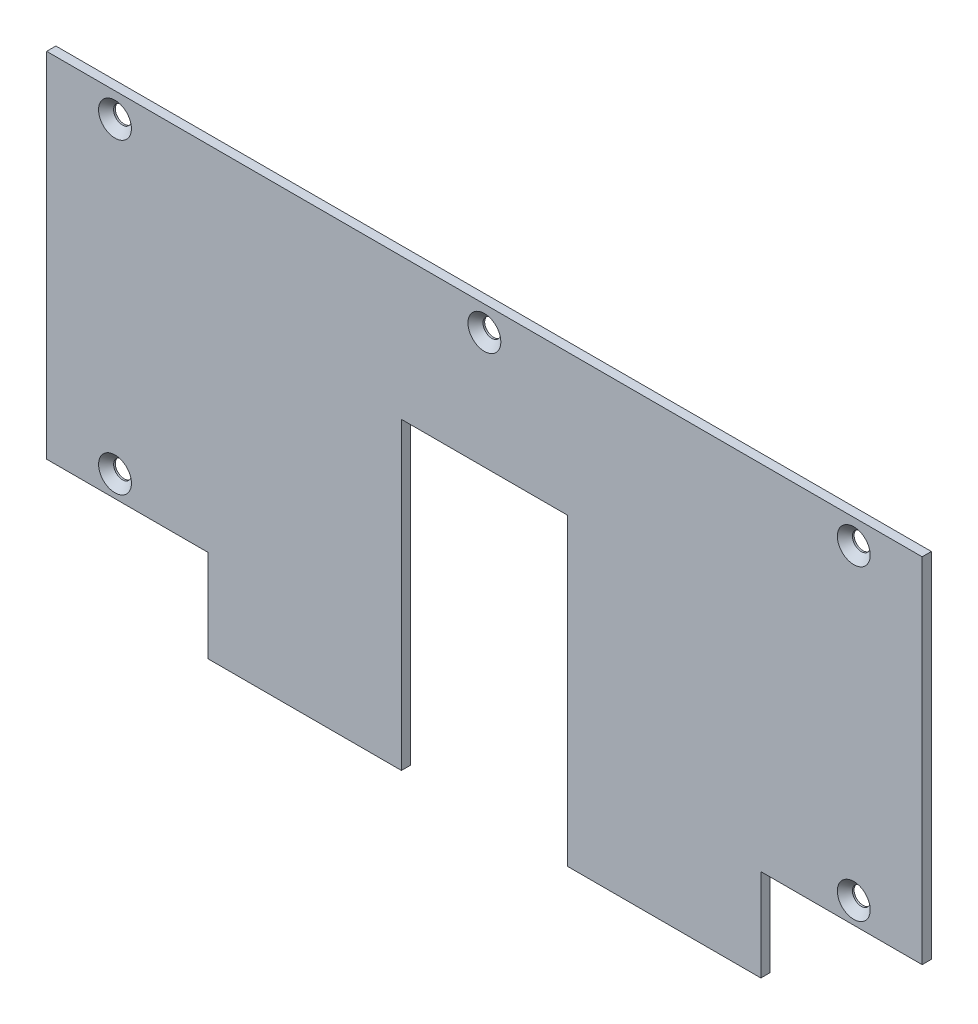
ISO-10303-21;
HEADER;
FILE_DESCRIPTION(('STEP AP214'),'2;1');
FILE_NAME('part.step','',(''),(''),'','','');
FILE_SCHEMA(('AUTOMOTIVE_DESIGN { 1 0 10303 214 1 1 1 1 }'));
ENDSEC;
DATA;
#1=APPLICATION_CONTEXT('core data for automotive mechanical design processes');
#2=APPLICATION_PROTOCOL_DEFINITION('international standard','automotive_design',2000,#1);
#3=PRODUCT_CONTEXT('',#1,'mechanical');
#4=PRODUCT('Part','Part','',(#3));
#5=PRODUCT_RELATED_PRODUCT_CATEGORY('part','',(#4));
#6=PRODUCT_DEFINITION_FORMATION('','',#4);
#7=PRODUCT_DEFINITION_CONTEXT('part definition',#1,'design');
#8=PRODUCT_DEFINITION('design','',#6,#7);
#9=PRODUCT_DEFINITION_SHAPE('','',#8);
#10=(LENGTH_UNIT() NAMED_UNIT(*) SI_UNIT(.MILLI.,.METRE.));
#11=(NAMED_UNIT(*) PLANE_ANGLE_UNIT() SI_UNIT($,.RADIAN.));
#12=(NAMED_UNIT(*) SI_UNIT($,.STERADIAN.) SOLID_ANGLE_UNIT());
#13=UNCERTAINTY_MEASURE_WITH_UNIT(LENGTH_MEASURE(1.E-05),#10,'distance_accuracy_value','');
#14=(GEOMETRIC_REPRESENTATION_CONTEXT(3) GLOBAL_UNCERTAINTY_ASSIGNED_CONTEXT((#13)) GLOBAL_UNIT_ASSIGNED_CONTEXT((#10,
#11,#12)) REPRESENTATION_CONTEXT('',''));
#15=CARTESIAN_POINT('',(0.,0.,0.));
#16=DIRECTION('',(0.,0.,1.));
#17=DIRECTION('',(1.,0.,0.));
#18=AXIS2_PLACEMENT_3D('',#15,#16,#17);
#19=CARTESIAN_POINT('',(0.,31.2258979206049,0.));
#20=DIRECTION('',(0.,0.,1.));
#21=DIRECTION('',(1.,0.,0.));
#22=AXIS2_PLACEMENT_3D('',#19,#20,#21);
#23=PLANE('',#22);
#24=CARTESIAN_POINT('',(-120.25,-8.,0.));
#25=DIRECTION('',(0.,0.,1.));
#26=DIRECTION('',(1.,0.,0.));
#27=AXIS2_PLACEMENT_3D('',#24,#25,#26);
#28=CIRCLE('',#27,5.34999999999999);
#29=CARTESIAN_POINT('',(-114.9,-8.,0.));
#30=VERTEX_POINT('',#29);
#31=EDGE_CURVE('E125',#30,#30,#28,.F.);
#32=ORIENTED_EDGE('',*,*,#31,.T.);
#33=EDGE_LOOP('',(#32));
#34=FACE_BOUND('',#33,.T.);
#35=CARTESIAN_POINT('',(-120.25,92.,0.));
#36=DIRECTION('',(0.,0.,1.));
#37=DIRECTION('',(1.,0.,0.));
#38=AXIS2_PLACEMENT_3D('',#35,#36,#37);
#39=CIRCLE('',#38,5.34999999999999);
#40=CARTESIAN_POINT('',(-114.9,92.,0.));
#41=VERTEX_POINT('',#40);
#42=EDGE_CURVE('E148',#41,#41,#39,.F.);
#43=ORIENTED_EDGE('',*,*,#42,.T.);
#44=EDGE_LOOP('',(#43));
#45=FACE_BOUND('',#44,.T.);
#46=CARTESIAN_POINT('',(0.,92.,0.));
#47=DIRECTION('',(0.,0.,1.));
#48=DIRECTION('',(1.,0.,0.));
#49=AXIS2_PLACEMENT_3D('',#46,#47,#48);
#50=CIRCLE('',#49,5.35);
#51=CARTESIAN_POINT('',(5.35000000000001,92.,0.));
#52=VERTEX_POINT('',#51);
#53=EDGE_CURVE('E151',#52,#52,#50,.F.);
#54=ORIENTED_EDGE('',*,*,#53,.T.);
#55=EDGE_LOOP('',(#54));
#56=FACE_BOUND('',#55,.T.);
#57=CARTESIAN_POINT('',(120.25,92.,0.));
#58=DIRECTION('',(0.,0.,1.));
#59=DIRECTION('',(1.,0.,0.));
#60=AXIS2_PLACEMENT_3D('',#57,#58,#59);
#61=CIRCLE('',#60,5.35000000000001);
#62=CARTESIAN_POINT('',(125.6,92.,0.));
#63=VERTEX_POINT('',#62);
#64=EDGE_CURVE('E153',#63,#63,#61,.F.);
#65=ORIENTED_EDGE('',*,*,#64,.T.);
#66=EDGE_LOOP('',(#65));
#67=FACE_BOUND('',#66,.T.);
#68=CARTESIAN_POINT('',(120.25,-8.,0.));
#69=DIRECTION('',(0.,0.,1.));
#70=DIRECTION('',(1.,0.,0.));
#71=AXIS2_PLACEMENT_3D('',#68,#69,#70);
#72=CIRCLE('',#71,5.34999999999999);
#73=CARTESIAN_POINT('',(125.6,-8.,0.));
#74=VERTEX_POINT('',#73);
#75=EDGE_CURVE('E19',#74,#74,#72,.F.);
#76=ORIENTED_EDGE('',*,*,#75,.T.);
#77=EDGE_LOOP('',(#76));
#78=FACE_BOUND('',#77,.T.);
#79=DIRECTION('',(0.,1.,0.));
#80=VECTOR('',#79,1.);
#81=CARTESIAN_POINT('',(-90.,-15.,0.));
#82=LINE('',#81,#80);
#83=CARTESIAN_POINT('',(-90.,-45.,0.));
#84=VERTEX_POINT('',#83);
#85=CARTESIAN_POINT('',(-90.,-15.,0.));
#86=VERTEX_POINT('',#85);
#87=EDGE_CURVE('E345',#84,#86,#82,.T.);
#88=ORIENTED_EDGE('',*,*,#87,.F.);
#89=DIRECTION('',(1.,0.,0.));
#90=VECTOR('',#89,1.);
#91=CARTESIAN_POINT('',(-90.,-45.,0.));
#92=LINE('',#91,#90);
#93=CARTESIAN_POINT('',(-27.,-45.,0.));
#94=VERTEX_POINT('',#93);
#95=EDGE_CURVE('E341',#94,#84,#92,.F.);
#96=ORIENTED_EDGE('',*,*,#95,.F.);
#97=DIRECTION('',(0.,1.,0.));
#98=VECTOR('',#97,1.);
#99=CARTESIAN_POINT('',(-27.,-45.,0.));
#100=LINE('',#99,#98);
#101=CARTESIAN_POINT('',(-27.,54.,0.));
#102=VERTEX_POINT('',#101);
#103=EDGE_CURVE('E338',#102,#94,#100,.F.);
#104=ORIENTED_EDGE('',*,*,#103,.F.);
#105=DIRECTION('',(1.,0.,0.));
#106=VECTOR('',#105,1.);
#107=CARTESIAN_POINT('',(-27.,54.,0.));
#108=LINE('',#107,#106);
#109=CARTESIAN_POINT('',(27.,54.,0.));
#110=VERTEX_POINT('',#109);
#111=EDGE_CURVE('E121',#110,#102,#108,.F.);
#112=ORIENTED_EDGE('',*,*,#111,.F.);
#113=DIRECTION('',(0.,1.,0.));
#114=VECTOR('',#113,1.);
#115=CARTESIAN_POINT('',(27.,54.,0.));
#116=LINE('',#115,#114);
#117=CARTESIAN_POINT('',(27.,-45.,0.));
#118=VERTEX_POINT('',#117);
#119=EDGE_CURVE('E116',#118,#110,#116,.T.);
#120=ORIENTED_EDGE('',*,*,#119,.F.);
#121=DIRECTION('',(1.,0.,0.));
#122=VECTOR('',#121,1.);
#123=CARTESIAN_POINT('',(27.,-45.,0.));
#124=LINE('',#123,#122);
#125=CARTESIAN_POINT('',(90.,-45.,0.));
#126=VERTEX_POINT('',#125);
#127=EDGE_CURVE('E107',#126,#118,#124,.F.);
#128=ORIENTED_EDGE('',*,*,#127,.F.);
#129=DIRECTION('',(0.,1.,0.));
#130=VECTOR('',#129,1.);
#131=CARTESIAN_POINT('',(90.,-45.,0.));
#132=LINE('',#131,#130);
#133=CARTESIAN_POINT('',(90.,-15.,0.));
#134=VERTEX_POINT('',#133);
#135=EDGE_CURVE('E102',#134,#126,#132,.F.);
#136=ORIENTED_EDGE('',*,*,#135,.F.);
#137=DIRECTION('',(1.,0.,0.));
#138=VECTOR('',#137,1.);
#139=CARTESIAN_POINT('',(90.,-15.,0.));
#140=LINE('',#139,#138);
#141=CARTESIAN_POINT('',(142.5,-15.,0.));
#142=VERTEX_POINT('',#141);
#143=EDGE_CURVE('E365',#142,#134,#140,.F.);
#144=ORIENTED_EDGE('',*,*,#143,.F.);
#145=DIRECTION('',(0.,1.,0.));
#146=VECTOR('',#145,1.);
#147=CARTESIAN_POINT('',(142.5,-15.,0.));
#148=LINE('',#147,#146);
#149=CARTESIAN_POINT('',(142.5,100.,0.));
#150=VERTEX_POINT('',#149);
#151=EDGE_CURVE('E361',#150,#142,#148,.F.);
#152=ORIENTED_EDGE('',*,*,#151,.F.);
#153=DIRECTION('',(1.,0.,0.));
#154=VECTOR('',#153,1.);
#155=CARTESIAN_POINT('',(142.5,100.,0.));
#156=LINE('',#155,#154);
#157=CARTESIAN_POINT('',(-142.5,100.,0.));
#158=VERTEX_POINT('',#157);
#159=EDGE_CURVE('E357',#158,#150,#156,.T.);
#160=ORIENTED_EDGE('',*,*,#159,.F.);
#161=DIRECTION('',(0.,1.,0.));
#162=VECTOR('',#161,1.);
#163=CARTESIAN_POINT('',(-142.5,100.,0.));
#164=LINE('',#163,#162);
#165=CARTESIAN_POINT('',(-142.5,-15.,0.));
#166=VERTEX_POINT('',#165);
#167=EDGE_CURVE('E353',#166,#158,#164,.T.);
#168=ORIENTED_EDGE('',*,*,#167,.F.);
#169=DIRECTION('',(1.,0.,0.));
#170=VECTOR('',#169,1.);
#171=CARTESIAN_POINT('',(-142.5,-15.,0.));
#172=LINE('',#171,#170);
#173=EDGE_CURVE('E349',#86,#166,#172,.F.);
#174=ORIENTED_EDGE('',*,*,#173,.F.);
#175=EDGE_LOOP('',(#88,#96,#104,#112,#120,#128,#136,#144,#152,#160,#168,#174));
#176=FACE_BOUND('',#175,.T.);
#177=ADVANCED_FACE('F15',(#34,#45,#56,#67,#78,#176),#23,.T.);
#178=CARTESIAN_POINT('',(120.25,-8.,0.));
#179=DIRECTION('',(0.,0.,1.));
#180=DIRECTION('',(1.,0.,0.));
#181=AXIS2_PLACEMENT_3D('',#178,#179,#180);
#182=CONICAL_SURFACE('',#181,5.35000000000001,0.785398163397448);
#183=CARTESIAN_POINT('',(120.25,-8.,-2.44999999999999));
#184=DIRECTION('',(0.,0.,-1.));
#185=DIRECTION('',(-1.,0.,0.));
#186=AXIS2_PLACEMENT_3D('',#183,#184,#185);
#187=CIRCLE('',#186,2.90000000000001);
#188=CARTESIAN_POINT('',(117.35,-8.,-2.44999999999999));
#189=VERTEX_POINT('',#188);
#190=EDGE_CURVE('E327',#189,#189,#187,.T.);
#191=ORIENTED_EDGE('',*,*,#190,.T.);
#192=EDGE_LOOP('',(#191));
#193=FACE_BOUND('',#192,.T.);
#194=ORIENTED_EDGE('',*,*,#75,.F.);
#195=EDGE_LOOP('',(#194));
#196=FACE_BOUND('',#195,.T.);
#197=ADVANCED_FACE('F161',(#193,#196),#182,.F.);
#198=CARTESIAN_POINT('',(120.25,92.,0.));
#199=DIRECTION('',(0.,0.,1.));
#200=DIRECTION('',(1.,0.,0.));
#201=AXIS2_PLACEMENT_3D('',#198,#199,#200);
#202=CONICAL_SURFACE('',#201,5.34999999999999,0.785398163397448);
#203=CARTESIAN_POINT('',(120.25,92.,-2.44999999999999));
#204=DIRECTION('',(0.,0.,-1.));
#205=DIRECTION('',(-1.,0.,0.));
#206=AXIS2_PLACEMENT_3D('',#203,#204,#205);
#207=CIRCLE('',#206,2.89999999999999);
#208=CARTESIAN_POINT('',(117.35,92.,-2.44999999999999));
#209=VERTEX_POINT('',#208);
#210=EDGE_CURVE('E322',#209,#209,#207,.T.);
#211=ORIENTED_EDGE('',*,*,#210,.T.);
#212=EDGE_LOOP('',(#211));
#213=FACE_BOUND('',#212,.T.);
#214=ORIENTED_EDGE('',*,*,#64,.F.);
#215=EDGE_LOOP('',(#214));
#216=FACE_BOUND('',#215,.T.);
#217=ADVANCED_FACE('F163',(#213,#216),#202,.F.);
#218=CARTESIAN_POINT('',(0.,92.,0.));
#219=DIRECTION('',(0.,0.,1.));
#220=DIRECTION('',(1.,0.,0.));
#221=AXIS2_PLACEMENT_3D('',#218,#219,#220);
#222=CONICAL_SURFACE('',#221,5.35,0.785398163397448);
#223=CARTESIAN_POINT('',(0.,92.,-2.44999999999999));
#224=DIRECTION('',(0.,0.,-1.));
#225=DIRECTION('',(-1.,0.,0.));
#226=AXIS2_PLACEMENT_3D('',#223,#224,#225);
#227=CIRCLE('',#226,2.9);
#228=CARTESIAN_POINT('',(-2.89999999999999,92.,-2.44999999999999));
#229=VERTEX_POINT('',#228);
#230=EDGE_CURVE('E317',#229,#229,#227,.T.);
#231=ORIENTED_EDGE('',*,*,#230,.T.);
#232=EDGE_LOOP('',(#231));
#233=FACE_BOUND('',#232,.T.);
#234=ORIENTED_EDGE('',*,*,#53,.F.);
#235=EDGE_LOOP('',(#234));
#236=FACE_BOUND('',#235,.T.);
#237=ADVANCED_FACE('F171',(#233,#236),#222,.F.);
#238=CARTESIAN_POINT('',(-120.25,92.,0.));
#239=DIRECTION('',(0.,0.,1.));
#240=DIRECTION('',(1.,0.,0.));
#241=AXIS2_PLACEMENT_3D('',#238,#239,#240);
#242=CONICAL_SURFACE('',#241,5.34999999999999,0.785398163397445);
#243=CARTESIAN_POINT('',(-120.25,92.,-2.44999999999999));
#244=DIRECTION('',(0.,0.,-1.));
#245=DIRECTION('',(-1.,0.,0.));
#246=AXIS2_PLACEMENT_3D('',#243,#244,#245);
#247=CIRCLE('',#246,2.90000000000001);
#248=CARTESIAN_POINT('',(-123.15,92.,-2.44999999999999));
#249=VERTEX_POINT('',#248);
#250=EDGE_CURVE('E264',#249,#249,#247,.T.);
#251=ORIENTED_EDGE('',*,*,#250,.T.);
#252=EDGE_LOOP('',(#251));
#253=FACE_BOUND('',#252,.T.);
#254=ORIENTED_EDGE('',*,*,#42,.F.);
#255=EDGE_LOOP('',(#254));
#256=FACE_BOUND('',#255,.T.);
#257=ADVANCED_FACE('F235',(#253,#256),#242,.F.);
#258=CARTESIAN_POINT('',(-120.25,-8.,0.));
#259=DIRECTION('',(0.,0.,1.));
#260=DIRECTION('',(1.,0.,0.));
#261=AXIS2_PLACEMENT_3D('',#258,#259,#260);
#262=CONICAL_SURFACE('',#261,5.34999999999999,0.785398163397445);
#263=CARTESIAN_POINT('',(-120.25,-8.,-2.44999999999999));
#264=DIRECTION('',(0.,0.,-1.));
#265=DIRECTION('',(-1.,0.,0.));
#266=AXIS2_PLACEMENT_3D('',#263,#264,#265);
#267=CIRCLE('',#266,2.90000000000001);
#268=CARTESIAN_POINT('',(-123.15,-8.,-2.44999999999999));
#269=VERTEX_POINT('',#268);
#270=EDGE_CURVE('E312',#269,#269,#267,.T.);
#271=ORIENTED_EDGE('',*,*,#270,.T.);
#272=EDGE_LOOP('',(#271));
#273=FACE_BOUND('',#272,.T.);
#274=ORIENTED_EDGE('',*,*,#31,.F.);
#275=EDGE_LOOP('',(#274));
#276=FACE_BOUND('',#275,.T.);
#277=ADVANCED_FACE('F231',(#273,#276),#262,.F.);
#278=CARTESIAN_POINT('',(27.,54.,0.));
#279=DIRECTION('',(-1.,0.,0.));
#280=DIRECTION('',(0.,0.,1.));
#281=AXIS2_PLACEMENT_3D('',#278,#279,#280);
#282=PLANE('',#281);
#283=ORIENTED_EDGE('',*,*,#119,.T.);
#284=DIRECTION('',(0.,0.,-1.));
#285=VECTOR('',#284,1.);
#286=CARTESIAN_POINT('',(27.,54.,0.));
#287=LINE('',#286,#285);
#288=CARTESIAN_POINT('',(27.,54.,-3.));
#289=VERTEX_POINT('',#288);
#290=EDGE_CURVE('E335',#289,#110,#287,.F.);
#291=ORIENTED_EDGE('',*,*,#290,.F.);
#292=DIRECTION('',(0.,1.,0.));
#293=VECTOR('',#292,1.);
#294=CARTESIAN_POINT('',(27.,31.2258979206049,-3.));
#295=LINE('',#294,#293);
#296=CARTESIAN_POINT('',(27.,-45.,-3.));
#297=VERTEX_POINT('',#296);
#298=EDGE_CURVE('E129',#289,#297,#295,.F.);
#299=ORIENTED_EDGE('',*,*,#298,.T.);
#300=DIRECTION('',(0.,0.,-1.));
#301=VECTOR('',#300,1.);
#302=CARTESIAN_POINT('',(27.,-45.,0.));
#303=LINE('',#302,#301);
#304=EDGE_CURVE('E112',#118,#297,#303,.T.);
#305=ORIENTED_EDGE('',*,*,#304,.F.);
#306=EDGE_LOOP('',(#283,#291,#299,#305));
#307=FACE_BOUND('',#306,.T.);
#308=ADVANCED_FACE('F128',(#307),#282,.T.);
#309=CARTESIAN_POINT('',(27.,-45.,0.));
#310=DIRECTION('',(0.,-1.,0.));
#311=DIRECTION('',(0.,0.,-1.));
#312=AXIS2_PLACEMENT_3D('',#309,#310,#311);
#313=PLANE('',#312);
#314=ORIENTED_EDGE('',*,*,#127,.T.);
#315=ORIENTED_EDGE('',*,*,#304,.T.);
#316=DIRECTION('',(1.,0.,0.));
#317=VECTOR('',#316,1.);
#318=CARTESIAN_POINT('',(0.,-45.,-3.));
#319=LINE('',#318,#317);
#320=CARTESIAN_POINT('',(90.,-45.,-3.));
#321=VERTEX_POINT('',#320);
#322=EDGE_CURVE('E309',#297,#321,#319,.T.);
#323=ORIENTED_EDGE('',*,*,#322,.T.);
#324=DIRECTION('',(0.,0.,-1.));
#325=VECTOR('',#324,1.);
#326=CARTESIAN_POINT('',(90.,-45.,0.));
#327=LINE('',#326,#325);
#328=EDGE_CURVE('E114',#126,#321,#327,.T.);
#329=ORIENTED_EDGE('',*,*,#328,.F.);
#330=EDGE_LOOP('',(#314,#315,#323,#329));
#331=FACE_BOUND('',#330,.T.);
#332=ADVANCED_FACE('F109',(#331),#313,.T.);
#333=CARTESIAN_POINT('',(90.,-45.,0.));
#334=DIRECTION('',(1.,0.,0.));
#335=DIRECTION('',(0.,0.,-1.));
#336=AXIS2_PLACEMENT_3D('',#333,#334,#335);
#337=PLANE('',#336);
#338=ORIENTED_EDGE('',*,*,#135,.T.);
#339=ORIENTED_EDGE('',*,*,#328,.T.);
#340=DIRECTION('',(0.,1.,0.));
#341=VECTOR('',#340,1.);
#342=CARTESIAN_POINT('',(90.,31.2258979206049,-3.));
#343=LINE('',#342,#341);
#344=CARTESIAN_POINT('',(90.,-15.,-3.));
#345=VERTEX_POINT('',#344);
#346=EDGE_CURVE('E306',#321,#345,#343,.T.);
#347=ORIENTED_EDGE('',*,*,#346,.T.);
#348=DIRECTION('',(0.,0.,-1.));
#349=VECTOR('',#348,1.);
#350=CARTESIAN_POINT('',(90.,-15.,0.));
#351=LINE('',#350,#349);
#352=EDGE_CURVE('E363',#134,#345,#351,.T.);
#353=ORIENTED_EDGE('',*,*,#352,.F.);
#354=EDGE_LOOP('',(#338,#339,#347,#353));
#355=FACE_BOUND('',#354,.T.);
#356=ADVANCED_FACE('F224',(#355),#337,.T.);
#357=CARTESIAN_POINT('',(90.,-15.,0.));
#358=DIRECTION('',(0.,-1.,0.));
#359=DIRECTION('',(0.,0.,-1.));
#360=AXIS2_PLACEMENT_3D('',#357,#358,#359);
#361=PLANE('',#360);
#362=ORIENTED_EDGE('',*,*,#143,.T.);
#363=ORIENTED_EDGE('',*,*,#352,.T.);
#364=DIRECTION('',(1.,0.,0.));
#365=VECTOR('',#364,1.);
#366=CARTESIAN_POINT('',(0.,-15.,-3.));
#367=LINE('',#366,#365);
#368=CARTESIAN_POINT('',(142.5,-15.,-3.));
#369=VERTEX_POINT('',#368);
#370=EDGE_CURVE('E303',#345,#369,#367,.T.);
#371=ORIENTED_EDGE('',*,*,#370,.T.);
#372=DIRECTION('',(0.,0.,-1.));
#373=VECTOR('',#372,1.);
#374=CARTESIAN_POINT('',(142.5,-15.,0.));
#375=LINE('',#374,#373);
#376=EDGE_CURVE('E359',#142,#369,#375,.T.);
#377=ORIENTED_EDGE('',*,*,#376,.F.);
#378=EDGE_LOOP('',(#362,#363,#371,#377));
#379=FACE_BOUND('',#378,.T.);
#380=ADVANCED_FACE('F220',(#379),#361,.T.);
#381=CARTESIAN_POINT('',(142.5,-15.,0.));
#382=DIRECTION('',(1.,0.,0.));
#383=DIRECTION('',(0.,0.,-1.));
#384=AXIS2_PLACEMENT_3D('',#381,#382,#383);
#385=PLANE('',#384);
#386=ORIENTED_EDGE('',*,*,#151,.T.);
#387=ORIENTED_EDGE('',*,*,#376,.T.);
#388=DIRECTION('',(0.,1.,0.));
#389=VECTOR('',#388,1.);
#390=CARTESIAN_POINT('',(142.5,31.2258979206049,-3.));
#391=LINE('',#390,#389);
#392=CARTESIAN_POINT('',(142.5,100.,-3.));
#393=VERTEX_POINT('',#392);
#394=EDGE_CURVE('E300',#369,#393,#391,.T.);
#395=ORIENTED_EDGE('',*,*,#394,.T.);
#396=DIRECTION('',(0.,0.,1.));
#397=VECTOR('',#396,1.);
#398=CARTESIAN_POINT('',(142.5,100.,0.));
#399=LINE('',#398,#397);
#400=EDGE_CURVE('E355',#150,#393,#399,.F.);
#401=ORIENTED_EDGE('',*,*,#400,.F.);
#402=EDGE_LOOP('',(#386,#387,#395,#401));
#403=FACE_BOUND('',#402,.T.);
#404=ADVANCED_FACE('F216',(#403),#385,.T.);
#405=CARTESIAN_POINT('',(142.5,100.,0.));
#406=DIRECTION('',(0.,1.,0.));
#407=DIRECTION('',(0.,0.,1.));
#408=AXIS2_PLACEMENT_3D('',#405,#406,#407);
#409=PLANE('',#408);
#410=ORIENTED_EDGE('',*,*,#159,.T.);
#411=ORIENTED_EDGE('',*,*,#400,.T.);
#412=DIRECTION('',(1.,0.,0.));
#413=VECTOR('',#412,1.);
#414=CARTESIAN_POINT('',(0.,100.,-3.));
#415=LINE('',#414,#413);
#416=CARTESIAN_POINT('',(-142.5,100.,-3.));
#417=VERTEX_POINT('',#416);
#418=EDGE_CURVE('E297',#393,#417,#415,.F.);
#419=ORIENTED_EDGE('',*,*,#418,.T.);
#420=DIRECTION('',(0.,0.,1.));
#421=VECTOR('',#420,1.);
#422=CARTESIAN_POINT('',(-142.5,100.,0.));
#423=LINE('',#422,#421);
#424=EDGE_CURVE('E351',#158,#417,#423,.F.);
#425=ORIENTED_EDGE('',*,*,#424,.F.);
#426=EDGE_LOOP('',(#410,#411,#419,#425));
#427=FACE_BOUND('',#426,.T.);
#428=ADVANCED_FACE('F212',(#427),#409,.T.);
#429=CARTESIAN_POINT('',(-142.5,100.,0.));
#430=DIRECTION('',(-1.,0.,0.));
#431=DIRECTION('',(0.,0.,1.));
#432=AXIS2_PLACEMENT_3D('',#429,#430,#431);
#433=PLANE('',#432);
#434=ORIENTED_EDGE('',*,*,#167,.T.);
#435=ORIENTED_EDGE('',*,*,#424,.T.);
#436=DIRECTION('',(0.,1.,0.));
#437=VECTOR('',#436,1.);
#438=CARTESIAN_POINT('',(-142.5,31.2258979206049,-3.));
#439=LINE('',#438,#437);
#440=CARTESIAN_POINT('',(-142.5,-15.,-3.));
#441=VERTEX_POINT('',#440);
#442=EDGE_CURVE('E294',#417,#441,#439,.F.);
#443=ORIENTED_EDGE('',*,*,#442,.T.);
#444=DIRECTION('',(0.,0.,-1.));
#445=VECTOR('',#444,1.);
#446=CARTESIAN_POINT('',(-142.5,-15.,0.));
#447=LINE('',#446,#445);
#448=EDGE_CURVE('E347',#166,#441,#447,.T.);
#449=ORIENTED_EDGE('',*,*,#448,.F.);
#450=EDGE_LOOP('',(#434,#435,#443,#449));
#451=FACE_BOUND('',#450,.T.);
#452=ADVANCED_FACE('F208',(#451),#433,.T.);
#453=CARTESIAN_POINT('',(-142.5,-15.,0.));
#454=DIRECTION('',(0.,-1.,0.));
#455=DIRECTION('',(0.,0.,-1.));
#456=AXIS2_PLACEMENT_3D('',#453,#454,#455);
#457=PLANE('',#456);
#458=ORIENTED_EDGE('',*,*,#173,.T.);
#459=ORIENTED_EDGE('',*,*,#448,.T.);
#460=DIRECTION('',(1.,0.,0.));
#461=VECTOR('',#460,1.);
#462=CARTESIAN_POINT('',(0.,-15.,-3.));
#463=LINE('',#462,#461);
#464=CARTESIAN_POINT('',(-90.,-15.,-3.));
#465=VERTEX_POINT('',#464);
#466=EDGE_CURVE('E288',#441,#465,#463,.T.);
#467=ORIENTED_EDGE('',*,*,#466,.T.);
#468=DIRECTION('',(0.,0.,1.));
#469=VECTOR('',#468,1.);
#470=CARTESIAN_POINT('',(-90.,-15.,0.));
#471=LINE('',#470,#469);
#472=EDGE_CURVE('E343',#86,#465,#471,.F.);
#473=ORIENTED_EDGE('',*,*,#472,.F.);
#474=EDGE_LOOP('',(#458,#459,#467,#473));
#475=FACE_BOUND('',#474,.T.);
#476=ADVANCED_FACE('F204',(#475),#457,.T.);
#477=CARTESIAN_POINT('',(-90.,-15.,0.));
#478=DIRECTION('',(-1.,0.,0.));
#479=DIRECTION('',(0.,0.,1.));
#480=AXIS2_PLACEMENT_3D('',#477,#478,#479);
#481=PLANE('',#480);
#482=ORIENTED_EDGE('',*,*,#87,.T.);
#483=ORIENTED_EDGE('',*,*,#472,.T.);
#484=DIRECTION('',(0.,1.,0.));
#485=VECTOR('',#484,1.);
#486=CARTESIAN_POINT('',(-90.,31.2258979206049,-3.));
#487=LINE('',#486,#485);
#488=CARTESIAN_POINT('',(-90.,-45.,-3.));
#489=VERTEX_POINT('',#488);
#490=EDGE_CURVE('E286',#465,#489,#487,.F.);
#491=ORIENTED_EDGE('',*,*,#490,.T.);
#492=DIRECTION('',(0.,0.,-1.));
#493=VECTOR('',#492,1.);
#494=CARTESIAN_POINT('',(-90.,-45.,0.));
#495=LINE('',#494,#493);
#496=EDGE_CURVE('E285',#84,#489,#495,.T.);
#497=ORIENTED_EDGE('',*,*,#496,.F.);
#498=EDGE_LOOP('',(#482,#483,#491,#497));
#499=FACE_BOUND('',#498,.T.);
#500=ADVANCED_FACE('F200',(#499),#481,.T.);
#501=CARTESIAN_POINT('',(-90.,-45.,0.));
#502=DIRECTION('',(0.,-1.,0.));
#503=DIRECTION('',(0.,0.,-1.));
#504=AXIS2_PLACEMENT_3D('',#501,#502,#503);
#505=PLANE('',#504);
#506=ORIENTED_EDGE('',*,*,#95,.T.);
#507=ORIENTED_EDGE('',*,*,#496,.T.);
#508=DIRECTION('',(1.,0.,0.));
#509=VECTOR('',#508,1.);
#510=CARTESIAN_POINT('',(0.,-45.,-3.));
#511=LINE('',#510,#509);
#512=CARTESIAN_POINT('',(-27.,-45.,-3.));
#513=VERTEX_POINT('',#512);
#514=EDGE_CURVE('E279',#489,#513,#511,.T.);
#515=ORIENTED_EDGE('',*,*,#514,.T.);
#516=DIRECTION('',(0.,0.,-1.));
#517=VECTOR('',#516,1.);
#518=CARTESIAN_POINT('',(-27.,-45.,0.));
#519=LINE('',#518,#517);
#520=EDGE_CURVE('E283',#94,#513,#519,.T.);
#521=ORIENTED_EDGE('',*,*,#520,.F.);
#522=EDGE_LOOP('',(#506,#507,#515,#521));
#523=FACE_BOUND('',#522,.T.);
#524=ADVANCED_FACE('F196',(#523),#505,.T.);
#525=CARTESIAN_POINT('',(-27.,-45.,0.));
#526=DIRECTION('',(1.,0.,0.));
#527=DIRECTION('',(0.,0.,-1.));
#528=AXIS2_PLACEMENT_3D('',#525,#526,#527);
#529=PLANE('',#528);
#530=ORIENTED_EDGE('',*,*,#103,.T.);
#531=ORIENTED_EDGE('',*,*,#520,.T.);
#532=DIRECTION('',(0.,1.,0.));
#533=VECTOR('',#532,1.);
#534=CARTESIAN_POINT('',(-27.,31.2258979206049,-3.));
#535=LINE('',#534,#533);
#536=CARTESIAN_POINT('',(-27.,54.,-3.));
#537=VERTEX_POINT('',#536);
#538=EDGE_CURVE('E276',#513,#537,#535,.T.);
#539=ORIENTED_EDGE('',*,*,#538,.T.);
#540=DIRECTION('',(0.,0.,-1.));
#541=VECTOR('',#540,1.);
#542=CARTESIAN_POINT('',(-27.,54.,0.));
#543=LINE('',#542,#541);
#544=EDGE_CURVE('E34',#102,#537,#543,.T.);
#545=ORIENTED_EDGE('',*,*,#544,.F.);
#546=EDGE_LOOP('',(#530,#531,#539,#545));
#547=FACE_BOUND('',#546,.T.);
#548=ADVANCED_FACE('F193',(#547),#529,.T.);
#549=CARTESIAN_POINT('',(-27.,54.,0.));
#550=DIRECTION('',(0.,-1.,0.));
#551=DIRECTION('',(0.,0.,-1.));
#552=AXIS2_PLACEMENT_3D('',#549,#550,#551);
#553=PLANE('',#552);
#554=ORIENTED_EDGE('',*,*,#111,.T.);
#555=ORIENTED_EDGE('',*,*,#544,.T.);
#556=DIRECTION('',(1.,0.,0.));
#557=VECTOR('',#556,1.);
#558=CARTESIAN_POINT('',(0.,54.,-3.));
#559=LINE('',#558,#557);
#560=EDGE_CURVE('E145',#537,#289,#559,.T.);
#561=ORIENTED_EDGE('',*,*,#560,.T.);
#562=ORIENTED_EDGE('',*,*,#290,.T.);
#563=EDGE_LOOP('',(#554,#555,#561,#562));
#564=FACE_BOUND('',#563,.T.);
#565=ADVANCED_FACE('F189',(#564),#553,.T.);
#566=CARTESIAN_POINT('',(120.25,-8.,-2.44999999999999));
#567=DIRECTION('',(0.,0.,-1.));
#568=DIRECTION('',(-1.,0.,0.));
#569=AXIS2_PLACEMENT_3D('',#566,#567,#568);
#570=CYLINDRICAL_SURFACE('',#569,2.90000000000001);
#571=ORIENTED_EDGE('',*,*,#190,.F.);
#572=EDGE_LOOP('',(#571));
#573=FACE_BOUND('',#572,.T.);
#574=CARTESIAN_POINT('',(120.25,-8.,-3.));
#575=DIRECTION('',(0.,0.,-1.));
#576=DIRECTION('',(-1.,0.,0.));
#577=AXIS2_PLACEMENT_3D('',#574,#575,#576);
#578=CIRCLE('',#577,2.90000000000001);
#579=CARTESIAN_POINT('',(117.35,-8.,-3.));
#580=VERTEX_POINT('',#579);
#581=EDGE_CURVE('E142',#580,#580,#578,.T.);
#582=ORIENTED_EDGE('',*,*,#581,.T.);
#583=EDGE_LOOP('',(#582));
#584=FACE_BOUND('',#583,.T.);
#585=ADVANCED_FACE('F192',(#573,#584),#570,.F.);
#586=CARTESIAN_POINT('',(120.25,92.,-2.44999999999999));
#587=DIRECTION('',(0.,0.,-1.));
#588=DIRECTION('',(-1.,0.,0.));
#589=AXIS2_PLACEMENT_3D('',#586,#587,#588);
#590=CYLINDRICAL_SURFACE('',#589,2.89999999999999);
#591=ORIENTED_EDGE('',*,*,#210,.F.);
#592=EDGE_LOOP('',(#591));
#593=FACE_BOUND('',#592,.T.);
#594=CARTESIAN_POINT('',(120.25,92.,-3.));
#595=DIRECTION('',(0.,0.,-1.));
#596=DIRECTION('',(-1.,0.,0.));
#597=AXIS2_PLACEMENT_3D('',#594,#595,#596);
#598=CIRCLE('',#597,2.89999999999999);
#599=CARTESIAN_POINT('',(117.35,92.,-3.));
#600=VERTEX_POINT('',#599);
#601=EDGE_CURVE('E139',#600,#600,#598,.T.);
#602=ORIENTED_EDGE('',*,*,#601,.T.);
#603=EDGE_LOOP('',(#602));
#604=FACE_BOUND('',#603,.T.);
#605=ADVANCED_FACE('F249',(#593,#604),#590,.F.);
#606=CARTESIAN_POINT('',(0.,92.,-2.44999999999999));
#607=DIRECTION('',(0.,0.,-1.));
#608=DIRECTION('',(-1.,0.,0.));
#609=AXIS2_PLACEMENT_3D('',#606,#607,#608);
#610=CYLINDRICAL_SURFACE('',#609,2.9);
#611=ORIENTED_EDGE('',*,*,#230,.F.);
#612=EDGE_LOOP('',(#611));
#613=FACE_BOUND('',#612,.T.);
#614=CARTESIAN_POINT('',(0.,92.,-3.));
#615=DIRECTION('',(0.,0.,-1.));
#616=DIRECTION('',(-1.,0.,0.));
#617=AXIS2_PLACEMENT_3D('',#614,#615,#616);
#618=CIRCLE('',#617,2.9);
#619=CARTESIAN_POINT('',(-2.89999999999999,92.,-3.));
#620=VERTEX_POINT('',#619);
#621=EDGE_CURVE('E136',#620,#620,#618,.T.);
#622=ORIENTED_EDGE('',*,*,#621,.T.);
#623=EDGE_LOOP('',(#622));
#624=FACE_BOUND('',#623,.T.);
#625=ADVANCED_FACE('F253',(#613,#624),#610,.F.);
#626=CARTESIAN_POINT('',(-120.25,92.,-2.44999999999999));
#627=DIRECTION('',(0.,0.,-1.));
#628=DIRECTION('',(-1.,0.,0.));
#629=AXIS2_PLACEMENT_3D('',#626,#627,#628);
#630=CYLINDRICAL_SURFACE('',#629,2.90000000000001);
#631=ORIENTED_EDGE('',*,*,#250,.F.);
#632=EDGE_LOOP('',(#631));
#633=FACE_BOUND('',#632,.T.);
#634=CARTESIAN_POINT('',(-120.25,92.,-3.));
#635=DIRECTION('',(0.,0.,-1.));
#636=DIRECTION('',(-1.,0.,0.));
#637=AXIS2_PLACEMENT_3D('',#634,#635,#636);
#638=CIRCLE('',#637,2.90000000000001);
#639=CARTESIAN_POINT('',(-123.15,92.,-3.));
#640=VERTEX_POINT('',#639);
#641=EDGE_CURVE('E25',#640,#640,#638,.T.);
#642=ORIENTED_EDGE('',*,*,#641,.T.);
#643=EDGE_LOOP('',(#642));
#644=FACE_BOUND('',#643,.T.);
#645=ADVANCED_FACE('F184',(#633,#644),#630,.F.);
#646=CARTESIAN_POINT('',(-120.25,-8.,-2.44999999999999));
#647=DIRECTION('',(0.,0.,-1.));
#648=DIRECTION('',(-1.,0.,0.));
#649=AXIS2_PLACEMENT_3D('',#646,#647,#648);
#650=CYLINDRICAL_SURFACE('',#649,2.90000000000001);
#651=ORIENTED_EDGE('',*,*,#270,.F.);
#652=EDGE_LOOP('',(#651));
#653=FACE_BOUND('',#652,.T.);
#654=CARTESIAN_POINT('',(-120.25,-8.,-3.));
#655=DIRECTION('',(0.,0.,-1.));
#656=DIRECTION('',(-1.,0.,0.));
#657=AXIS2_PLACEMENT_3D('',#654,#655,#656);
#658=CIRCLE('',#657,2.90000000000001);
#659=CARTESIAN_POINT('',(-123.15,-8.,-3.));
#660=VERTEX_POINT('',#659);
#661=EDGE_CURVE('E10',#660,#660,#658,.T.);
#662=ORIENTED_EDGE('',*,*,#661,.T.);
#663=EDGE_LOOP('',(#662));
#664=FACE_BOUND('',#663,.T.);
#665=ADVANCED_FACE('F17',(#653,#664),#650,.F.);
#666=CARTESIAN_POINT('',(0.,31.2258979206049,-3.));
#667=DIRECTION('',(0.,0.,1.));
#668=DIRECTION('',(1.,0.,0.));
#669=AXIS2_PLACEMENT_3D('',#666,#667,#668);
#670=PLANE('',#669);
#671=ORIENTED_EDGE('',*,*,#661,.F.);
#672=EDGE_LOOP('',(#671));
#673=FACE_BOUND('',#672,.T.);
#674=ORIENTED_EDGE('',*,*,#641,.F.);
#675=EDGE_LOOP('',(#674));
#676=FACE_BOUND('',#675,.T.);
#677=ORIENTED_EDGE('',*,*,#621,.F.);
#678=EDGE_LOOP('',(#677));
#679=FACE_BOUND('',#678,.T.);
#680=ORIENTED_EDGE('',*,*,#601,.F.);
#681=EDGE_LOOP('',(#680));
#682=FACE_BOUND('',#681,.T.);
#683=ORIENTED_EDGE('',*,*,#581,.F.);
#684=EDGE_LOOP('',(#683));
#685=FACE_BOUND('',#684,.T.);
#686=ORIENTED_EDGE('',*,*,#538,.F.);
#687=ORIENTED_EDGE('',*,*,#514,.F.);
#688=ORIENTED_EDGE('',*,*,#490,.F.);
#689=ORIENTED_EDGE('',*,*,#466,.F.);
#690=ORIENTED_EDGE('',*,*,#442,.F.);
#691=ORIENTED_EDGE('',*,*,#418,.F.);
#692=ORIENTED_EDGE('',*,*,#394,.F.);
#693=ORIENTED_EDGE('',*,*,#370,.F.);
#694=ORIENTED_EDGE('',*,*,#346,.F.);
#695=ORIENTED_EDGE('',*,*,#322,.F.);
#696=ORIENTED_EDGE('',*,*,#298,.F.);
#697=ORIENTED_EDGE('',*,*,#560,.F.);
#698=EDGE_LOOP('',(#686,#687,#688,#689,#690,#691,#692,#693,#694,#695,#696,#697));
#699=FACE_BOUND('',#698,.T.);
#700=ADVANCED_FACE('F177',(#673,#676,#679,#682,#685,#699),#670,.F.);
#701=CLOSED_SHELL('',(#177,#197,#217,#237,#257,#277,#308,#332,#356,#380,#404,#428,#452,#476,
#500,#524,#548,#565,#585,#605,#625,#645,#665,#700));
#702=MANIFOLD_SOLID_BREP('B1',#701);
#703=ADVANCED_BREP_SHAPE_REPRESENTATION('',(#18,#702),#14);
#704=SHAPE_DEFINITION_REPRESENTATION(#9,#703);
ENDSEC;
END-ISO-10303-21;
